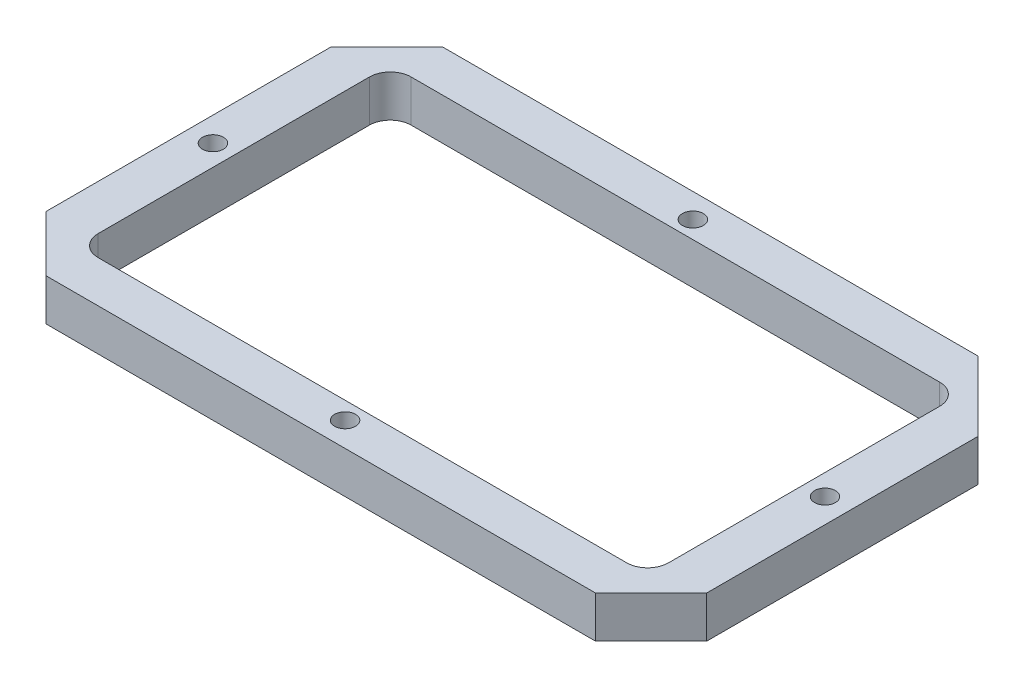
ISO-10303-21;
HEADER;
FILE_DESCRIPTION(('STEP AP214'),'2;1');
FILE_NAME('part.step','',(''),(''),'','','');
FILE_SCHEMA(('AUTOMOTIVE_DESIGN { 1 0 10303 214 1 1 1 1 }'));
ENDSEC;
DATA;
#1=APPLICATION_CONTEXT('core data for automotive mechanical design processes');
#2=APPLICATION_PROTOCOL_DEFINITION('international standard','automotive_design',2000,#1);
#3=PRODUCT_CONTEXT('',#1,'mechanical');
#4=PRODUCT('Part','Part','',(#3));
#5=PRODUCT_RELATED_PRODUCT_CATEGORY('part','',(#4));
#6=PRODUCT_DEFINITION_FORMATION('','',#4);
#7=PRODUCT_DEFINITION_CONTEXT('part definition',#1,'design');
#8=PRODUCT_DEFINITION('design','',#6,#7);
#9=PRODUCT_DEFINITION_SHAPE('','',#8);
#10=(LENGTH_UNIT() NAMED_UNIT(*) SI_UNIT(.MILLI.,.METRE.));
#11=(NAMED_UNIT(*) PLANE_ANGLE_UNIT() SI_UNIT($,.RADIAN.));
#12=(NAMED_UNIT(*) SI_UNIT($,.STERADIAN.) SOLID_ANGLE_UNIT());
#13=UNCERTAINTY_MEASURE_WITH_UNIT(LENGTH_MEASURE(1.E-05),#10,'distance_accuracy_value','');
#14=(GEOMETRIC_REPRESENTATION_CONTEXT(3) GLOBAL_UNCERTAINTY_ASSIGNED_CONTEXT((#13)) GLOBAL_UNIT_ASSIGNED_CONTEXT((#10,
#11,#12)) REPRESENTATION_CONTEXT('',''));
#15=CARTESIAN_POINT('',(0.,0.,0.));
#16=DIRECTION('',(0.,0.,1.));
#17=DIRECTION('',(1.,0.,0.));
#18=AXIS2_PLACEMENT_3D('',#15,#16,#17);
#19=CARTESIAN_POINT('',(0.,6.,0.));
#20=DIRECTION('',(0.,-1.,0.));
#21=DIRECTION('',(0.,0.,-1.));
#22=AXIS2_PLACEMENT_3D('',#19,#20,#21);
#23=PLANE('',#22);
#24=CARTESIAN_POINT('',(-44.,6.,0.));
#25=DIRECTION('',(0.,1.,0.));
#26=DIRECTION('',(0.,0.,1.));
#27=AXIS2_PLACEMENT_3D('',#24,#25,#26);
#28=CIRCLE('',#27,1.5);
#29=CARTESIAN_POINT('',(-44.,6.,1.5));
#30=VERTEX_POINT('',#29);
#31=EDGE_CURVE('E558',#30,#30,#28,.T.);
#32=ORIENTED_EDGE('',*,*,#31,.F.);
#33=EDGE_LOOP('',(#32));
#34=FACE_BOUND('',#33,.T.);
#35=CARTESIAN_POINT('',(0.,6.,-25.));
#36=DIRECTION('',(0.,1.,0.));
#37=DIRECTION('',(0.,0.,1.));
#38=AXIS2_PLACEMENT_3D('',#35,#36,#37);
#39=CIRCLE('',#38,1.5);
#40=CARTESIAN_POINT('',(0.,6.,-23.5));
#41=VERTEX_POINT('',#40);
#42=EDGE_CURVE('E188',#41,#41,#39,.T.);
#43=ORIENTED_EDGE('',*,*,#42,.F.);
#44=EDGE_LOOP('',(#43));
#45=FACE_BOUND('',#44,.T.);
#46=DIRECTION('',(-1.,0.,0.));
#47=VECTOR('',#46,1.);
#48=CARTESIAN_POINT('',(-39.5,6.,-28.5));
#49=LINE('',#48,#47);
#50=CARTESIAN_POINT('',(37.5,6.,-28.5));
#51=VERTEX_POINT('',#50);
#52=CARTESIAN_POINT('',(-39.5,6.,-28.5));
#53=VERTEX_POINT('',#52);
#54=EDGE_CURVE('E218',#51,#53,#49,.T.);
#55=ORIENTED_EDGE('',*,*,#54,.T.);
#56=DIRECTION('',(-0.707106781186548,0.,0.707106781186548));
#57=VECTOR('',#56,1.);
#58=CARTESIAN_POINT('',(-47.5,6.,-20.5));
#59=LINE('',#58,#57);
#60=CARTESIAN_POINT('',(-47.5,6.,-20.5));
#61=VERTEX_POINT('',#60);
#62=EDGE_CURVE('E221',#53,#61,#59,.T.);
#63=ORIENTED_EDGE('',*,*,#62,.T.);
#64=DIRECTION('',(0.,0.,1.));
#65=VECTOR('',#64,1.);
#66=CARTESIAN_POINT('',(-47.5,6.,-20.5));
#67=LINE('',#66,#65);
#68=CARTESIAN_POINT('',(-47.5,6.,20.5));
#69=VERTEX_POINT('',#68);
#70=EDGE_CURVE('E224',#61,#69,#67,.T.);
#71=ORIENTED_EDGE('',*,*,#70,.T.);
#72=DIRECTION('',(0.707106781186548,0.,0.707106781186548));
#73=VECTOR('',#72,1.);
#74=CARTESIAN_POINT('',(-47.5,6.,20.5));
#75=LINE('',#74,#73);
#76=CARTESIAN_POINT('',(-39.5,6.,28.5));
#77=VERTEX_POINT('',#76);
#78=EDGE_CURVE('E226',#69,#77,#75,.T.);
#79=ORIENTED_EDGE('',*,*,#78,.T.);
#80=DIRECTION('',(1.,0.,0.));
#81=VECTOR('',#80,1.);
#82=CARTESIAN_POINT('',(-39.5,6.,28.5));
#83=LINE('',#82,#81);
#84=CARTESIAN_POINT('',(39.5,6.,28.5));
#85=VERTEX_POINT('',#84);
#86=EDGE_CURVE('E228',#77,#85,#83,.T.);
#87=ORIENTED_EDGE('',*,*,#86,.T.);
#88=DIRECTION('',(0.707106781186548,0.,-0.707106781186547));
#89=VECTOR('',#88,1.);
#90=CARTESIAN_POINT('',(39.5,6.,28.5));
#91=LINE('',#90,#89);
#92=CARTESIAN_POINT('',(47.5,6.,20.5));
#93=VERTEX_POINT('',#92);
#94=EDGE_CURVE('E230',#85,#93,#91,.T.);
#95=ORIENTED_EDGE('',*,*,#94,.T.);
#96=DIRECTION('',(0.,0.,-1.));
#97=VECTOR('',#96,1.);
#98=CARTESIAN_POINT('',(47.5,6.,-18.5));
#99=LINE('',#98,#97);
#100=CARTESIAN_POINT('',(47.5,6.,-18.5));
#101=VERTEX_POINT('',#100);
#102=EDGE_CURVE('E232',#93,#101,#99,.T.);
#103=ORIENTED_EDGE('',*,*,#102,.T.);
#104=DIRECTION('',(-0.707106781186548,0.,-0.707106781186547));
#105=VECTOR('',#104,1.);
#106=CARTESIAN_POINT('',(37.5,6.,-28.5));
#107=LINE('',#106,#105);
#108=EDGE_CURVE('E234',#101,#51,#107,.T.);
#109=ORIENTED_EDGE('',*,*,#108,.T.);
#110=EDGE_LOOP('',(#55,#63,#71,#79,#87,#95,#103,#109));
#111=FACE_BOUND('',#110,.T.);
#112=CARTESIAN_POINT('',(-38.,6.,-19.5));
#113=DIRECTION('',(0.,1.,0.));
#114=DIRECTION('',(0.,0.,1.));
#115=AXIS2_PLACEMENT_3D('',#112,#113,#114);
#116=CIRCLE('',#115,3.);
#117=CARTESIAN_POINT('',(-38.,6.,-22.5));
#118=VERTEX_POINT('',#117);
#119=CARTESIAN_POINT('',(-41.,6.,-19.5));
#120=VERTEX_POINT('',#119);
#121=EDGE_CURVE('E150',#118,#120,#116,.T.);
#122=ORIENTED_EDGE('',*,*,#121,.F.);
#123=DIRECTION('',(-1.,0.,0.));
#124=VECTOR('',#123,1.);
#125=CARTESIAN_POINT('',(-38.,6.,-22.5));
#126=LINE('',#125,#124);
#127=CARTESIAN_POINT('',(38.,6.,-22.5));
#128=VERTEX_POINT('',#127);
#129=EDGE_CURVE('E185',#128,#118,#126,.T.);
#130=ORIENTED_EDGE('',*,*,#129,.F.);
#131=CARTESIAN_POINT('',(38.,6.,-19.5));
#132=DIRECTION('',(0.,1.,0.));
#133=DIRECTION('',(0.,0.,-1.));
#134=AXIS2_PLACEMENT_3D('',#131,#132,#133);
#135=CIRCLE('',#134,3.);
#136=CARTESIAN_POINT('',(41.,6.,-19.5));
#137=VERTEX_POINT('',#136);
#138=EDGE_CURVE('E183',#137,#128,#135,.T.);
#139=ORIENTED_EDGE('',*,*,#138,.F.);
#140=DIRECTION('',(0.,0.,-1.));
#141=VECTOR('',#140,1.);
#142=CARTESIAN_POINT('',(41.,6.,-19.5));
#143=LINE('',#142,#141);
#144=CARTESIAN_POINT('',(41.,6.,19.5));
#145=VERTEX_POINT('',#144);
#146=EDGE_CURVE('E181',#145,#137,#143,.T.);
#147=ORIENTED_EDGE('',*,*,#146,.F.);
#148=CARTESIAN_POINT('',(38.,6.,19.5));
#149=DIRECTION('',(0.,1.,0.));
#150=DIRECTION('',(0.,0.,1.));
#151=AXIS2_PLACEMENT_3D('',#148,#149,#150);
#152=CIRCLE('',#151,3.);
#153=CARTESIAN_POINT('',(38.,6.,22.5));
#154=VERTEX_POINT('',#153);
#155=EDGE_CURVE('E179',#154,#145,#152,.T.);
#156=ORIENTED_EDGE('',*,*,#155,.F.);
#157=DIRECTION('',(1.,0.,0.));
#158=VECTOR('',#157,1.);
#159=CARTESIAN_POINT('',(-38.,6.,22.5));
#160=LINE('',#159,#158);
#161=CARTESIAN_POINT('',(-38.,6.,22.5));
#162=VERTEX_POINT('',#161);
#163=EDGE_CURVE('E174',#162,#154,#160,.T.);
#164=ORIENTED_EDGE('',*,*,#163,.F.);
#165=CARTESIAN_POINT('',(-38.,6.,19.5));
#166=DIRECTION('',(0.,1.,0.));
#167=DIRECTION('',(0.,0.,1.));
#168=AXIS2_PLACEMENT_3D('',#165,#166,#167);
#169=CIRCLE('',#168,3.);
#170=CARTESIAN_POINT('',(-41.,6.,19.5));
#171=VERTEX_POINT('',#170);
#172=EDGE_CURVE('E172',#171,#162,#169,.T.);
#173=ORIENTED_EDGE('',*,*,#172,.F.);
#174=DIRECTION('',(0.,0.,1.));
#175=VECTOR('',#174,1.);
#176=CARTESIAN_POINT('',(-41.,6.,-19.5));
#177=LINE('',#176,#175);
#178=EDGE_CURVE('E158',#120,#171,#177,.T.);
#179=ORIENTED_EDGE('',*,*,#178,.F.);
#180=EDGE_LOOP('',(#122,#130,#139,#147,#156,#164,#173,#179));
#181=FACE_BOUND('',#180,.T.);
#182=CARTESIAN_POINT('',(0.,6.,25.));
#183=DIRECTION('',(0.,1.,0.));
#184=DIRECTION('',(0.,0.,-1.));
#185=AXIS2_PLACEMENT_3D('',#182,#183,#184);
#186=CIRCLE('',#185,1.5);
#187=CARTESIAN_POINT('',(0.,6.,23.5));
#188=VERTEX_POINT('',#187);
#189=EDGE_CURVE('E557',#188,#188,#186,.T.);
#190=ORIENTED_EDGE('',*,*,#189,.F.);
#191=EDGE_LOOP('',(#190));
#192=FACE_BOUND('',#191,.T.);
#193=CARTESIAN_POINT('',(44.,6.,0.));
#194=DIRECTION('',(0.,1.,0.));
#195=DIRECTION('',(0.,0.,-1.));
#196=AXIS2_PLACEMENT_3D('',#193,#194,#195);
#197=CIRCLE('',#196,1.5);
#198=CARTESIAN_POINT('',(44.,6.,-1.50000000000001));
#199=VERTEX_POINT('',#198);
#200=EDGE_CURVE('E344',#199,#199,#197,.T.);
#201=ORIENTED_EDGE('',*,*,#200,.F.);
#202=EDGE_LOOP('',(#201));
#203=FACE_BOUND('',#202,.T.);
#204=ADVANCED_FACE('F37',(#34,#45,#111,#181,#192,#203),#23,.F.);
#205=CARTESIAN_POINT('',(0.,0.,0.));
#206=DIRECTION('',(0.,-1.,0.));
#207=DIRECTION('',(0.,0.,-1.));
#208=AXIS2_PLACEMENT_3D('',#205,#206,#207);
#209=PLANE('',#208);
#210=CARTESIAN_POINT('',(-44.,0.,0.));
#211=DIRECTION('',(0.,1.,0.));
#212=DIRECTION('',(0.,0.,1.));
#213=AXIS2_PLACEMENT_3D('',#210,#211,#212);
#214=CIRCLE('',#213,1.5);
#215=CARTESIAN_POINT('',(-44.,0.,1.5));
#216=VERTEX_POINT('',#215);
#217=EDGE_CURVE('E564',#216,#216,#214,.T.);
#218=ORIENTED_EDGE('',*,*,#217,.T.);
#219=EDGE_LOOP('',(#218));
#220=FACE_BOUND('',#219,.T.);
#221=CARTESIAN_POINT('',(0.,0.,-25.));
#222=DIRECTION('',(0.,1.,0.));
#223=DIRECTION('',(0.,0.,1.));
#224=AXIS2_PLACEMENT_3D('',#221,#222,#223);
#225=CIRCLE('',#224,1.5);
#226=CARTESIAN_POINT('',(0.,0.,-23.5));
#227=VERTEX_POINT('',#226);
#228=EDGE_CURVE('E561',#227,#227,#225,.T.);
#229=ORIENTED_EDGE('',*,*,#228,.T.);
#230=EDGE_LOOP('',(#229));
#231=FACE_BOUND('',#230,.T.);
#232=DIRECTION('',(-1.,0.,0.));
#233=VECTOR('',#232,1.);
#234=CARTESIAN_POINT('',(-39.5,0.,-28.5));
#235=LINE('',#234,#233);
#236=CARTESIAN_POINT('',(37.5,0.,-28.5));
#237=VERTEX_POINT('',#236);
#238=CARTESIAN_POINT('',(-39.5,0.,-28.5));
#239=VERTEX_POINT('',#238);
#240=EDGE_CURVE('E166',#237,#239,#235,.T.);
#241=ORIENTED_EDGE('',*,*,#240,.F.);
#242=DIRECTION('',(-0.707106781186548,0.,-0.707106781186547));
#243=VECTOR('',#242,1.);
#244=CARTESIAN_POINT('',(37.5,0.,-28.5));
#245=LINE('',#244,#243);
#246=CARTESIAN_POINT('',(47.5,0.,-18.5));
#247=VERTEX_POINT('',#246);
#248=EDGE_CURVE('E222',#247,#237,#245,.T.);
#249=ORIENTED_EDGE('',*,*,#248,.F.);
#250=DIRECTION('',(0.,0.,-1.));
#251=VECTOR('',#250,1.);
#252=CARTESIAN_POINT('',(47.5,0.,-18.5));
#253=LINE('',#252,#251);
#254=CARTESIAN_POINT('',(47.5,0.,20.5));
#255=VERTEX_POINT('',#254);
#256=EDGE_CURVE('E249',#255,#247,#253,.T.);
#257=ORIENTED_EDGE('',*,*,#256,.F.);
#258=DIRECTION('',(0.707106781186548,0.,-0.707106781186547));
#259=VECTOR('',#258,1.);
#260=CARTESIAN_POINT('',(39.5,0.,28.5));
#261=LINE('',#260,#259);
#262=CARTESIAN_POINT('',(39.5,0.,28.5));
#263=VERTEX_POINT('',#262);
#264=EDGE_CURVE('E247',#263,#255,#261,.T.);
#265=ORIENTED_EDGE('',*,*,#264,.F.);
#266=DIRECTION('',(1.,0.,0.));
#267=VECTOR('',#266,1.);
#268=CARTESIAN_POINT('',(-39.5,0.,28.5));
#269=LINE('',#268,#267);
#270=CARTESIAN_POINT('',(-39.5,0.,28.5));
#271=VERTEX_POINT('',#270);
#272=EDGE_CURVE('E245',#271,#263,#269,.T.);
#273=ORIENTED_EDGE('',*,*,#272,.F.);
#274=DIRECTION('',(0.707106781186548,0.,0.707106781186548));
#275=VECTOR('',#274,1.);
#276=CARTESIAN_POINT('',(-47.5,0.,20.5));
#277=LINE('',#276,#275);
#278=CARTESIAN_POINT('',(-47.5,0.,20.5));
#279=VERTEX_POINT('',#278);
#280=EDGE_CURVE('E243',#279,#271,#277,.T.);
#281=ORIENTED_EDGE('',*,*,#280,.F.);
#282=DIRECTION('',(0.,0.,1.));
#283=VECTOR('',#282,1.);
#284=CARTESIAN_POINT('',(-47.5,0.,-20.5));
#285=LINE('',#284,#283);
#286=CARTESIAN_POINT('',(-47.5,0.,-20.5));
#287=VERTEX_POINT('',#286);
#288=EDGE_CURVE('E241',#287,#279,#285,.T.);
#289=ORIENTED_EDGE('',*,*,#288,.F.);
#290=DIRECTION('',(-0.707106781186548,0.,0.707106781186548));
#291=VECTOR('',#290,1.);
#292=CARTESIAN_POINT('',(-47.5,0.,-20.5));
#293=LINE('',#292,#291);
#294=EDGE_CURVE('E239',#239,#287,#293,.T.);
#295=ORIENTED_EDGE('',*,*,#294,.F.);
#296=EDGE_LOOP('',(#241,#249,#257,#265,#273,#281,#289,#295));
#297=FACE_BOUND('',#296,.T.);
#298=DIRECTION('',(-1.,0.,0.));
#299=VECTOR('',#298,1.);
#300=CARTESIAN_POINT('',(-38.,0.,-22.5));
#301=LINE('',#300,#299);
#302=CARTESIAN_POINT('',(38.,0.,-22.5));
#303=VERTEX_POINT('',#302);
#304=CARTESIAN_POINT('',(-38.,0.,-22.5));
#305=VERTEX_POINT('',#304);
#306=EDGE_CURVE('E159',#303,#305,#301,.T.);
#307=ORIENTED_EDGE('',*,*,#306,.T.);
#308=CARTESIAN_POINT('',(-38.,0.,-19.5));
#309=DIRECTION('',(0.,1.,0.));
#310=DIRECTION('',(0.,0.,1.));
#311=AXIS2_PLACEMENT_3D('',#308,#309,#310);
#312=CIRCLE('',#311,3.);
#313=CARTESIAN_POINT('',(-41.,0.,-19.5));
#314=VERTEX_POINT('',#313);
#315=EDGE_CURVE('E60',#305,#314,#312,.T.);
#316=ORIENTED_EDGE('',*,*,#315,.T.);
#317=DIRECTION('',(0.,0.,1.));
#318=VECTOR('',#317,1.);
#319=CARTESIAN_POINT('',(-41.,0.,-19.5));
#320=LINE('',#319,#318);
#321=CARTESIAN_POINT('',(-41.,0.,19.5));
#322=VERTEX_POINT('',#321);
#323=EDGE_CURVE('E165',#314,#322,#320,.T.);
#324=ORIENTED_EDGE('',*,*,#323,.T.);
#325=CARTESIAN_POINT('',(-38.,0.,19.5));
#326=DIRECTION('',(0.,1.,0.));
#327=DIRECTION('',(0.,0.,1.));
#328=AXIS2_PLACEMENT_3D('',#325,#326,#327);
#329=CIRCLE('',#328,3.);
#330=CARTESIAN_POINT('',(-38.,0.,22.5));
#331=VERTEX_POINT('',#330);
#332=EDGE_CURVE('E190',#322,#331,#329,.T.);
#333=ORIENTED_EDGE('',*,*,#332,.T.);
#334=DIRECTION('',(1.,0.,0.));
#335=VECTOR('',#334,1.);
#336=CARTESIAN_POINT('',(-38.,0.,22.5));
#337=LINE('',#336,#335);
#338=CARTESIAN_POINT('',(38.,0.,22.5));
#339=VERTEX_POINT('',#338);
#340=EDGE_CURVE('E193',#331,#339,#337,.T.);
#341=ORIENTED_EDGE('',*,*,#340,.T.);
#342=CARTESIAN_POINT('',(38.,0.,19.5));
#343=DIRECTION('',(0.,1.,0.));
#344=DIRECTION('',(0.,0.,1.));
#345=AXIS2_PLACEMENT_3D('',#342,#343,#344);
#346=CIRCLE('',#345,3.);
#347=CARTESIAN_POINT('',(41.,0.,19.5));
#348=VERTEX_POINT('',#347);
#349=EDGE_CURVE('E196',#339,#348,#346,.T.);
#350=ORIENTED_EDGE('',*,*,#349,.T.);
#351=DIRECTION('',(0.,0.,-1.));
#352=VECTOR('',#351,1.);
#353=CARTESIAN_POINT('',(41.,0.,-19.5));
#354=LINE('',#353,#352);
#355=CARTESIAN_POINT('',(41.,0.,-19.5));
#356=VERTEX_POINT('',#355);
#357=EDGE_CURVE('E199',#348,#356,#354,.T.);
#358=ORIENTED_EDGE('',*,*,#357,.T.);
#359=CARTESIAN_POINT('',(38.,0.,-19.5));
#360=DIRECTION('',(0.,1.,0.));
#361=DIRECTION('',(0.,0.,-1.));
#362=AXIS2_PLACEMENT_3D('',#359,#360,#361);
#363=CIRCLE('',#362,3.);
#364=EDGE_CURVE('E202',#356,#303,#363,.T.);
#365=ORIENTED_EDGE('',*,*,#364,.T.);
#366=EDGE_LOOP('',(#307,#316,#324,#333,#341,#350,#358,#365));
#367=FACE_BOUND('',#366,.T.);
#368=CARTESIAN_POINT('',(0.,0.,25.));
#369=DIRECTION('',(0.,1.,0.));
#370=DIRECTION('',(0.,0.,-1.));
#371=AXIS2_PLACEMENT_3D('',#368,#369,#370);
#372=CIRCLE('',#371,1.5);
#373=CARTESIAN_POINT('',(0.,0.,23.5));
#374=VERTEX_POINT('',#373);
#375=EDGE_CURVE('E553',#374,#374,#372,.T.);
#376=ORIENTED_EDGE('',*,*,#375,.T.);
#377=EDGE_LOOP('',(#376));
#378=FACE_BOUND('',#377,.T.);
#379=CARTESIAN_POINT('',(44.,0.,0.));
#380=DIRECTION('',(0.,1.,0.));
#381=DIRECTION('',(0.,0.,-1.));
#382=AXIS2_PLACEMENT_3D('',#379,#380,#381);
#383=CIRCLE('',#382,1.5);
#384=CARTESIAN_POINT('',(44.,0.,-1.50000000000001));
#385=VERTEX_POINT('',#384);
#386=EDGE_CURVE('E340',#385,#385,#383,.T.);
#387=ORIENTED_EDGE('',*,*,#386,.T.);
#388=EDGE_LOOP('',(#387));
#389=FACE_BOUND('',#388,.T.);
#390=ADVANCED_FACE('F279',(#220,#231,#297,#367,#378,#389),#209,.T.);
#391=CARTESIAN_POINT('',(-39.5,6.,-28.5));
#392=DIRECTION('',(0.,0.,1.));
#393=DIRECTION('',(1.,0.,0.));
#394=AXIS2_PLACEMENT_3D('',#391,#392,#393);
#395=PLANE('',#394);
#396=ORIENTED_EDGE('',*,*,#240,.T.);
#397=DIRECTION('',(0.,-1.,0.));
#398=VECTOR('',#397,1.);
#399=CARTESIAN_POINT('',(-39.5,6.,-28.5));
#400=LINE('',#399,#398);
#401=EDGE_CURVE('E11',#53,#239,#400,.T.);
#402=ORIENTED_EDGE('',*,*,#401,.F.);
#403=ORIENTED_EDGE('',*,*,#54,.F.);
#404=DIRECTION('',(0.,-1.,0.));
#405=VECTOR('',#404,1.);
#406=CARTESIAN_POINT('',(37.5,6.,-28.5));
#407=LINE('',#406,#405);
#408=EDGE_CURVE('E236',#51,#237,#407,.T.);
#409=ORIENTED_EDGE('',*,*,#408,.T.);
#410=EDGE_LOOP('',(#396,#402,#403,#409));
#411=FACE_BOUND('',#410,.T.);
#412=ADVANCED_FACE('F39',(#411),#395,.F.);
#413=CARTESIAN_POINT('',(-47.5,6.,-20.5));
#414=DIRECTION('',(0.707106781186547,0.,0.707106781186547));
#415=DIRECTION('',(0.707106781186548,0.,-0.707106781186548));
#416=AXIS2_PLACEMENT_3D('',#413,#414,#415);
#417=PLANE('',#416);
#418=ORIENTED_EDGE('',*,*,#294,.T.);
#419=DIRECTION('',(0.,-1.,0.));
#420=VECTOR('',#419,1.);
#421=CARTESIAN_POINT('',(-47.5,6.,-20.5));
#422=LINE('',#421,#420);
#423=EDGE_CURVE('E45',#61,#287,#422,.T.);
#424=ORIENTED_EDGE('',*,*,#423,.F.);
#425=ORIENTED_EDGE('',*,*,#62,.F.);
#426=ORIENTED_EDGE('',*,*,#401,.T.);
#427=EDGE_LOOP('',(#418,#424,#425,#426));
#428=FACE_BOUND('',#427,.T.);
#429=ADVANCED_FACE('F296',(#428),#417,.F.);
#430=CARTESIAN_POINT('',(-47.5,6.,-20.5));
#431=DIRECTION('',(1.,0.,0.));
#432=DIRECTION('',(0.,0.,-1.));
#433=AXIS2_PLACEMENT_3D('',#430,#431,#432);
#434=PLANE('',#433);
#435=ORIENTED_EDGE('',*,*,#288,.T.);
#436=DIRECTION('',(0.,-1.,0.));
#437=VECTOR('',#436,1.);
#438=CARTESIAN_POINT('',(-47.5,6.,20.5));
#439=LINE('',#438,#437);
#440=EDGE_CURVE('E266',#69,#279,#439,.T.);
#441=ORIENTED_EDGE('',*,*,#440,.F.);
#442=ORIENTED_EDGE('',*,*,#70,.F.);
#443=ORIENTED_EDGE('',*,*,#423,.T.);
#444=EDGE_LOOP('',(#435,#441,#442,#443));
#445=FACE_BOUND('',#444,.T.);
#446=ADVANCED_FACE('F273',(#445),#434,.F.);
#447=CARTESIAN_POINT('',(-47.5,6.,20.5));
#448=DIRECTION('',(0.707106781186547,0.,-0.707106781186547));
#449=DIRECTION('',(-0.707106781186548,0.,-0.707106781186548));
#450=AXIS2_PLACEMENT_3D('',#447,#448,#449);
#451=PLANE('',#450);
#452=ORIENTED_EDGE('',*,*,#280,.T.);
#453=DIRECTION('',(0.,-1.,0.));
#454=VECTOR('',#453,1.);
#455=CARTESIAN_POINT('',(-39.5,6.,28.5));
#456=LINE('',#455,#454);
#457=EDGE_CURVE('E263',#77,#271,#456,.T.);
#458=ORIENTED_EDGE('',*,*,#457,.F.);
#459=ORIENTED_EDGE('',*,*,#78,.F.);
#460=ORIENTED_EDGE('',*,*,#440,.T.);
#461=EDGE_LOOP('',(#452,#458,#459,#460));
#462=FACE_BOUND('',#461,.T.);
#463=ADVANCED_FACE('F285',(#462),#451,.F.);
#464=CARTESIAN_POINT('',(-39.5,6.,28.5));
#465=DIRECTION('',(0.,0.,-1.));
#466=DIRECTION('',(-1.,0.,0.));
#467=AXIS2_PLACEMENT_3D('',#464,#465,#466);
#468=PLANE('',#467);
#469=ORIENTED_EDGE('',*,*,#272,.T.);
#470=DIRECTION('',(0.,-1.,0.));
#471=VECTOR('',#470,1.);
#472=CARTESIAN_POINT('',(39.5,6.,28.5));
#473=LINE('',#472,#471);
#474=EDGE_CURVE('E260',#85,#263,#473,.T.);
#475=ORIENTED_EDGE('',*,*,#474,.F.);
#476=ORIENTED_EDGE('',*,*,#86,.F.);
#477=ORIENTED_EDGE('',*,*,#457,.T.);
#478=EDGE_LOOP('',(#469,#475,#476,#477));
#479=FACE_BOUND('',#478,.T.);
#480=ADVANCED_FACE('F289',(#479),#468,.F.);
#481=CARTESIAN_POINT('',(39.5,6.,28.5));
#482=DIRECTION('',(-0.707106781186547,0.,-0.707106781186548));
#483=DIRECTION('',(-0.707106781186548,0.,0.707106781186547));
#484=AXIS2_PLACEMENT_3D('',#481,#482,#483);
#485=PLANE('',#484);
#486=ORIENTED_EDGE('',*,*,#264,.T.);
#487=DIRECTION('',(0.,-1.,0.));
#488=VECTOR('',#487,1.);
#489=CARTESIAN_POINT('',(47.5,6.,20.5));
#490=LINE('',#489,#488);
#491=EDGE_CURVE('E257',#93,#255,#490,.T.);
#492=ORIENTED_EDGE('',*,*,#491,.F.);
#493=ORIENTED_EDGE('',*,*,#94,.F.);
#494=ORIENTED_EDGE('',*,*,#474,.T.);
#495=EDGE_LOOP('',(#486,#492,#493,#494));
#496=FACE_BOUND('',#495,.T.);
#497=ADVANCED_FACE('F309',(#496),#485,.F.);
#498=CARTESIAN_POINT('',(47.5,6.,-18.5));
#499=DIRECTION('',(-1.,0.,0.));
#500=DIRECTION('',(0.,0.,1.));
#501=AXIS2_PLACEMENT_3D('',#498,#499,#500);
#502=PLANE('',#501);
#503=ORIENTED_EDGE('',*,*,#256,.T.);
#504=DIRECTION('',(0.,-1.,0.));
#505=VECTOR('',#504,1.);
#506=CARTESIAN_POINT('',(47.5,6.,-18.5));
#507=LINE('',#506,#505);
#508=EDGE_CURVE('E254',#101,#247,#507,.T.);
#509=ORIENTED_EDGE('',*,*,#508,.F.);
#510=ORIENTED_EDGE('',*,*,#102,.F.);
#511=ORIENTED_EDGE('',*,*,#491,.T.);
#512=EDGE_LOOP('',(#503,#509,#510,#511));
#513=FACE_BOUND('',#512,.T.);
#514=ADVANCED_FACE('F307',(#513),#502,.F.);
#515=CARTESIAN_POINT('',(37.5,6.,-28.5));
#516=DIRECTION('',(-0.707106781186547,0.,0.707106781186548));
#517=DIRECTION('',(0.707106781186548,0.,0.707106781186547));
#518=AXIS2_PLACEMENT_3D('',#515,#516,#517);
#519=PLANE('',#518);
#520=CARTESIAN_POINT('',(42.5,3.,-23.5));
#521=DIRECTION('',(0.707106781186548,0.,-0.707106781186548));
#522=DIRECTION('',(-0.707106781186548,0.,-0.707106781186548));
#523=AXIS2_PLACEMENT_3D('',#520,#521,#522);
#524=CIRCLE('',#523,1.);
#525=CARTESIAN_POINT('',(41.7928932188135,3.,-24.2071067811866));
#526=VERTEX_POINT('',#525);
#527=EDGE_CURVE('E338',#526,#526,#524,.T.);
#528=ORIENTED_EDGE('',*,*,#527,.F.);
#529=EDGE_LOOP('',(#528));
#530=FACE_BOUND('',#529,.T.);
#531=ORIENTED_EDGE('',*,*,#248,.T.);
#532=ORIENTED_EDGE('',*,*,#408,.F.);
#533=ORIENTED_EDGE('',*,*,#108,.F.);
#534=ORIENTED_EDGE('',*,*,#508,.T.);
#535=EDGE_LOOP('',(#531,#532,#533,#534));
#536=FACE_BOUND('',#535,.T.);
#537=ADVANCED_FACE('F302',(#530,#536),#519,.F.);
#538=CARTESIAN_POINT('',(-38.,6.,-19.5));
#539=DIRECTION('',(0.,-1.,0.));
#540=DIRECTION('',(0.,0.,-1.));
#541=AXIS2_PLACEMENT_3D('',#538,#539,#540);
#542=CYLINDRICAL_SURFACE('',#541,3.);
#543=ORIENTED_EDGE('',*,*,#315,.F.);
#544=DIRECTION('',(0.,-1.,0.));
#545=VECTOR('',#544,1.);
#546=CARTESIAN_POINT('',(-38.,6.,-22.5));
#547=LINE('',#546,#545);
#548=EDGE_CURVE('E154',#118,#305,#547,.T.);
#549=ORIENTED_EDGE('',*,*,#548,.F.);
#550=ORIENTED_EDGE('',*,*,#121,.T.);
#551=DIRECTION('',(0.,-1.,0.));
#552=VECTOR('',#551,1.);
#553=CARTESIAN_POINT('',(-41.,6.,-19.5));
#554=LINE('',#553,#552);
#555=EDGE_CURVE('E153',#120,#314,#554,.T.);
#556=ORIENTED_EDGE('',*,*,#555,.T.);
#557=EDGE_LOOP('',(#543,#549,#550,#556));
#558=FACE_BOUND('',#557,.T.);
#559=ADVANCED_FACE('F152',(#558),#542,.F.);
#560=CARTESIAN_POINT('',(-41.,6.,-19.5));
#561=DIRECTION('',(1.,0.,0.));
#562=DIRECTION('',(0.,0.,-1.));
#563=AXIS2_PLACEMENT_3D('',#560,#561,#562);
#564=PLANE('',#563);
#565=ORIENTED_EDGE('',*,*,#323,.F.);
#566=ORIENTED_EDGE('',*,*,#555,.F.);
#567=ORIENTED_EDGE('',*,*,#178,.T.);
#568=DIRECTION('',(0.,-1.,0.));
#569=VECTOR('',#568,1.);
#570=CARTESIAN_POINT('',(-41.,6.,19.5));
#571=LINE('',#570,#569);
#572=EDGE_CURVE('E167',#171,#322,#571,.T.);
#573=ORIENTED_EDGE('',*,*,#572,.T.);
#574=EDGE_LOOP('',(#565,#566,#567,#573));
#575=FACE_BOUND('',#574,.T.);
#576=ADVANCED_FACE('F162',(#575),#564,.T.);
#577=CARTESIAN_POINT('',(-38.,6.,19.5));
#578=DIRECTION('',(0.,-1.,0.));
#579=DIRECTION('',(0.,0.,-1.));
#580=AXIS2_PLACEMENT_3D('',#577,#578,#579);
#581=CYLINDRICAL_SURFACE('',#580,3.);
#582=ORIENTED_EDGE('',*,*,#332,.F.);
#583=ORIENTED_EDGE('',*,*,#572,.F.);
#584=ORIENTED_EDGE('',*,*,#172,.T.);
#585=DIRECTION('',(0.,-1.,0.));
#586=VECTOR('',#585,1.);
#587=CARTESIAN_POINT('',(-38.,6.,22.5));
#588=LINE('',#587,#586);
#589=EDGE_CURVE('E215',#162,#331,#588,.T.);
#590=ORIENTED_EDGE('',*,*,#589,.T.);
#591=EDGE_LOOP('',(#582,#583,#584,#590));
#592=FACE_BOUND('',#591,.T.);
#593=ADVANCED_FACE('F393',(#592),#581,.F.);
#594=CARTESIAN_POINT('',(-38.,6.,22.5));
#595=DIRECTION('',(0.,0.,-1.));
#596=DIRECTION('',(-1.,0.,0.));
#597=AXIS2_PLACEMENT_3D('',#594,#595,#596);
#598=PLANE('',#597);
#599=ORIENTED_EDGE('',*,*,#340,.F.);
#600=ORIENTED_EDGE('',*,*,#589,.F.);
#601=ORIENTED_EDGE('',*,*,#163,.T.);
#602=DIRECTION('',(0.,-1.,0.));
#603=VECTOR('',#602,1.);
#604=CARTESIAN_POINT('',(38.,6.,22.5));
#605=LINE('',#604,#603);
#606=EDGE_CURVE('E213',#154,#339,#605,.T.);
#607=ORIENTED_EDGE('',*,*,#606,.T.);
#608=EDGE_LOOP('',(#599,#600,#601,#607));
#609=FACE_BOUND('',#608,.T.);
#610=ADVANCED_FACE('F389',(#609),#598,.T.);
#611=CARTESIAN_POINT('',(38.,6.,19.5));
#612=DIRECTION('',(0.,-1.,0.));
#613=DIRECTION('',(0.,0.,-1.));
#614=AXIS2_PLACEMENT_3D('',#611,#612,#613);
#615=CYLINDRICAL_SURFACE('',#614,3.);
#616=ORIENTED_EDGE('',*,*,#349,.F.);
#617=ORIENTED_EDGE('',*,*,#606,.F.);
#618=ORIENTED_EDGE('',*,*,#155,.T.);
#619=DIRECTION('',(0.,-1.,0.));
#620=VECTOR('',#619,1.);
#621=CARTESIAN_POINT('',(41.,6.,19.5));
#622=LINE('',#621,#620);
#623=EDGE_CURVE('E211',#145,#348,#622,.T.);
#624=ORIENTED_EDGE('',*,*,#623,.T.);
#625=EDGE_LOOP('',(#616,#617,#618,#624));
#626=FACE_BOUND('',#625,.T.);
#627=ADVANCED_FACE('F385',(#626),#615,.F.);
#628=CARTESIAN_POINT('',(41.,6.,-19.5));
#629=DIRECTION('',(-1.,0.,0.));
#630=DIRECTION('',(0.,0.,1.));
#631=AXIS2_PLACEMENT_3D('',#628,#629,#630);
#632=PLANE('',#631);
#633=ORIENTED_EDGE('',*,*,#357,.F.);
#634=ORIENTED_EDGE('',*,*,#623,.F.);
#635=ORIENTED_EDGE('',*,*,#146,.T.);
#636=DIRECTION('',(0.,-1.,0.));
#637=VECTOR('',#636,1.);
#638=CARTESIAN_POINT('',(41.,6.,-19.5));
#639=LINE('',#638,#637);
#640=EDGE_CURVE('E209',#137,#356,#639,.T.);
#641=ORIENTED_EDGE('',*,*,#640,.T.);
#642=EDGE_LOOP('',(#633,#634,#635,#641));
#643=FACE_BOUND('',#642,.T.);
#644=ADVANCED_FACE('F381',(#643),#632,.T.);
#645=CARTESIAN_POINT('',(38.,6.,-19.5));
#646=DIRECTION('',(0.,-1.,0.));
#647=DIRECTION('',(0.,0.,-1.));
#648=AXIS2_PLACEMENT_3D('',#645,#646,#647);
#649=CYLINDRICAL_SURFACE('',#648,3.);
#650=CARTESIAN_POINT('',(39.6143790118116,3.,-22.0285925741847));
#651=CARTESIAN_POINT('',(39.6143789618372,3.0556139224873,-22.0285925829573));
#652=CARTESIAN_POINT('',(39.6184029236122,3.11122751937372,-22.0260369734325));
#653=CARTESIAN_POINT('',(39.6342677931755,3.22084500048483,-22.0158013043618));
#654=CARTESIAN_POINT('',(39.6461094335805,3.27484873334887,-22.0081207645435));
#655=CARTESIAN_POINT('',(39.6769462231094,3.37968202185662,-21.9876075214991));
#656=CARTESIAN_POINT('',(39.6959347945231,3.43051444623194,-21.9747795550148));
#657=CARTESIAN_POINT('',(39.740107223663,3.52771479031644,-21.943921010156));
#658=CARTESIAN_POINT('',(39.7652919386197,3.57408209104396,-21.9258897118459));
#659=CARTESIAN_POINT('',(39.8211115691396,3.66181348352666,-21.8842776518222));
#660=CARTESIAN_POINT('',(39.8518243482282,3.70308966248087,-21.8606158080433));
#661=CARTESIAN_POINT('',(39.9170487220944,3.77865445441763,-21.8079595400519));
#662=CARTESIAN_POINT('',(39.9515601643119,3.81294334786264,-21.7789653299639));
#663=CARTESIAN_POINT('',(40.0227762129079,3.87342982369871,-21.7159930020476));
#664=CARTESIAN_POINT('',(40.0594733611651,3.89965322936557,-21.6820313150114));
#665=CARTESIAN_POINT('',(40.1336131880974,3.94333597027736,-21.609591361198));
#666=CARTESIAN_POINT('',(40.1710556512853,3.96079780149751,-21.5711143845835));
#667=CARTESIAN_POINT('',(40.2439047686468,3.98599786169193,-21.491905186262));
#668=CARTESIAN_POINT('',(40.2793371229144,3.99405029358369,-21.4512962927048));
#669=CARTESIAN_POINT('',(40.3482918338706,4.00136477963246,-21.3677415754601));
#670=CARTESIAN_POINT('',(40.3818143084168,4.00062737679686,-21.3247958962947));
#671=CARTESIAN_POINT('',(40.4456901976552,3.99061030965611,-21.238236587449));
#672=CARTESIAN_POINT('',(40.4760714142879,3.98141430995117,-21.1946336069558));
#673=CARTESIAN_POINT('',(40.5334368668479,3.95504891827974,-21.1076121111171));
#674=CARTESIAN_POINT('',(40.5604204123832,3.93787790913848,-21.0641936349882));
#675=CARTESIAN_POINT('',(40.6118364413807,3.89519336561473,-20.9768200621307));
#676=CARTESIAN_POINT('',(40.6360941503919,3.86933196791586,-20.9329323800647));
#677=CARTESIAN_POINT('',(40.6804742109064,3.81026724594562,-20.8480927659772));
#678=CARTESIAN_POINT('',(40.7005947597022,3.77706073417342,-20.8071421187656));
#679=CARTESIAN_POINT('',(40.737888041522,3.70183849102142,-20.7272042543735));
#680=CARTESIAN_POINT('',(40.7548092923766,3.65941179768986,-20.6884850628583));
#681=CARTESIAN_POINT('',(40.7843303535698,3.56805998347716,-20.6175791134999));
#682=CARTESIAN_POINT('',(40.7969297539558,3.51913424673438,-20.5853929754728));
#683=CARTESIAN_POINT('',(40.8179500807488,3.41640909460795,-20.5295832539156));
#684=CARTESIAN_POINT('',(40.8264105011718,3.36266177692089,-20.5058793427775));
#685=CARTESIAN_POINT('',(40.8395234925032,3.25142086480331,-20.4682513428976));
#686=CARTESIAN_POINT('',(40.8441798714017,3.19393107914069,-20.4543174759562));
#687=CARTESIAN_POINT('',(40.8495444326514,3.08277105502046,-20.4381688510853));
#688=CARTESIAN_POINT('',(40.8505871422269,3.02926023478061,-20.4349621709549));
#689=CARTESIAN_POINT('',(40.8496858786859,2.92250626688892,-20.4377063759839));
#690=CARTESIAN_POINT('',(40.8477426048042,2.86926305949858,-20.4436551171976));
#691=CARTESIAN_POINT('',(40.8410250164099,2.76766302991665,-20.4636791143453));
#692=CARTESIAN_POINT('',(40.8364158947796,2.7191997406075,-20.477279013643));
#693=CARTESIAN_POINT('',(40.8244187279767,2.6251599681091,-20.511426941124));
#694=CARTESIAN_POINT('',(40.8170300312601,2.57958416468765,-20.5319765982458));
#695=CARTESIAN_POINT('',(40.7988241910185,2.48964348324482,-20.5804114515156));
#696=CARTESIAN_POINT('',(40.7878298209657,2.4455104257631,-20.6086591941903));
#697=CARTESIAN_POINT('',(40.7624057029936,2.36232134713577,-20.6705699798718));
#698=CARTESIAN_POINT('',(40.747974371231,2.3232676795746,-20.7042355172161));
#699=CARTESIAN_POINT('',(40.71394333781,2.24745456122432,-20.7792033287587));
#700=CARTESIAN_POINT('',(40.6939807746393,2.21127403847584,-20.8209283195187));
#701=CARTESIAN_POINT('',(40.6495750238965,2.14668448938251,-20.9078830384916));
#702=CARTESIAN_POINT('',(40.6251307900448,2.11827728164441,-20.9531135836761));
#703=CARTESIAN_POINT('',(40.5711439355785,2.06948319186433,-21.0466748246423));
#704=CARTESIAN_POINT('',(40.541490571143,2.04931108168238,-21.0950544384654));
#705=CARTESIAN_POINT('',(40.4779164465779,2.01887063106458,-21.1921256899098));
#706=CARTESIAN_POINT('',(40.4439975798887,2.0085979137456,-21.2408171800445));
#707=CARTESIAN_POINT('',(40.3747214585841,1.99884377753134,-21.3340894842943));
#708=CARTESIAN_POINT('',(40.3395493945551,1.99879345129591,-21.3787482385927));
#709=CARTESIAN_POINT('',(40.2672535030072,2.00825974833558,-21.4653858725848));
#710=CARTESIAN_POINT('',(40.230130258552,2.0177735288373,-21.5073655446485));
#711=CARTESIAN_POINT('',(40.1571893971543,2.04544561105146,-21.5854859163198));
#712=CARTESIAN_POINT('',(40.1213984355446,2.06315139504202,-21.6218130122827));
#713=CARTESIAN_POINT('',(40.0506374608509,2.10651016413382,-21.6902765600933));
#714=CARTESIAN_POINT('',(40.0156674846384,2.13216350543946,-21.722412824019));
#715=CARTESIAN_POINT('',(39.9476028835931,2.19094378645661,-21.7823056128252));
#716=CARTESIAN_POINT('',(39.9145270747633,2.22413339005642,-21.8100218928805));
#717=CARTESIAN_POINT('',(39.8518987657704,2.29696303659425,-21.8605280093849));
#718=CARTESIAN_POINT('',(39.8223470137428,2.33660444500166,-21.8833168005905));
#719=CARTESIAN_POINT('',(39.7670548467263,2.42280344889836,-21.9246137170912));
#720=CARTESIAN_POINT('',(39.7414823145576,2.46955333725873,-21.9429458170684));
#721=CARTESIAN_POINT('',(39.6966471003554,2.56763770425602,-21.9742959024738));
#722=CARTESIAN_POINT('',(39.6773842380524,2.61897205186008,-21.9873140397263));
#723=CARTESIAN_POINT('',(39.6462704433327,2.72446396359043,-22.0080157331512));
#724=CARTESIAN_POINT('',(39.6343686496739,2.77859928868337,-22.0157359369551));
#725=CARTESIAN_POINT('',(39.6184235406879,2.88849001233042,-22.0260239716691));
#726=CARTESIAN_POINT('',(39.6143790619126,2.94424516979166,-22.02859256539));
#727=CARTESIAN_POINT('',(39.6143790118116,3.,-22.0285925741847));
#728=B_SPLINE_CURVE_WITH_KNOTS('',3,(#650,#651,#652,#653,#654,#655,#656,#657,#658,#659,#660,
#661,#662,#663,#664,#665,#666,#667,#668,#669,#670,#671,#672,#673,#674,#675,#676,#677,#678,#679,
#680,#681,#682,#683,#684,#685,#686,#687,#688,#689,#690,#691,#692,#693,#694,#695,#696,#697,#698,
#699,#700,#701,#702,#703,#704,#705,#706,#707,#708,#709,#710,#711,#712,#713,#714,#715,#716,#717,
#718,#719,#720,#721,#722,#723,#724,#725,#726,#727),.UNSPECIFIED.,.T.,.F.,(4,2,2,2,2,2,2,2,2,2,2,
2,2,2,2,2,2,2,2,2,2,2,2,2,2,2,2,2,2,2,2,2,2,2,2,2,2,2,4),(0.,0.166640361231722,
0.333296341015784,0.499799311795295,0.666325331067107,0.835412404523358,1.00449268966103,
1.1730258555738,1.34151098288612,1.50419281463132,1.66686459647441,1.8279444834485,
1.98905704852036,2.15759129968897,2.32619883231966,2.50499123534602,2.68380059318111,
2.86086875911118,3.03775945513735,3.19776045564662,3.35772399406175,3.50870016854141,
3.65971175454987,3.81967252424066,3.97970715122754,4.15508490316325,4.33050365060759,
4.51024293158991,4.68990270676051,4.85956096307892,5.02916880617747,5.19035801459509,
5.35155444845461,5.51414378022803,5.67676756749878,5.84503568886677,6.01329900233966,
6.18038631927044,6.3474488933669),.UNSPECIFIED.);
#729=CARTESIAN_POINT('',(39.6143790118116,3.,-22.0285925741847));
#730=VERTEX_POINT('',#729);
#731=EDGE_CURVE('E341',#730,#730,#728,.T.);
#732=ORIENTED_EDGE('',*,*,#731,.T.);
#733=EDGE_LOOP('',(#732));
#734=FACE_BOUND('',#733,.T.);
#735=ORIENTED_EDGE('',*,*,#364,.F.);
#736=ORIENTED_EDGE('',*,*,#640,.F.);
#737=ORIENTED_EDGE('',*,*,#138,.T.);
#738=DIRECTION('',(0.,-1.,0.));
#739=VECTOR('',#738,1.);
#740=CARTESIAN_POINT('',(38.,6.,-22.5));
#741=LINE('',#740,#739);
#742=EDGE_CURVE('E52',#128,#303,#741,.T.);
#743=ORIENTED_EDGE('',*,*,#742,.T.);
#744=EDGE_LOOP('',(#735,#736,#737,#743));
#745=FACE_BOUND('',#744,.T.);
#746=ADVANCED_FACE('F378',(#734,#745),#649,.F.);
#747=CARTESIAN_POINT('',(-38.,6.,-22.5));
#748=DIRECTION('',(0.,0.,1.));
#749=DIRECTION('',(1.,0.,0.));
#750=AXIS2_PLACEMENT_3D('',#747,#748,#749);
#751=PLANE('',#750);
#752=ORIENTED_EDGE('',*,*,#306,.F.);
#753=ORIENTED_EDGE('',*,*,#742,.F.);
#754=ORIENTED_EDGE('',*,*,#129,.T.);
#755=ORIENTED_EDGE('',*,*,#548,.T.);
#756=EDGE_LOOP('',(#752,#753,#754,#755));
#757=FACE_BOUND('',#756,.T.);
#758=ADVANCED_FACE('F374',(#757),#751,.T.);
#759=CARTESIAN_POINT('',(0.,6.,-25.));
#760=DIRECTION('',(0.,-1.,0.));
#761=DIRECTION('',(0.,0.,-1.));
#762=AXIS2_PLACEMENT_3D('',#759,#760,#761);
#763=CYLINDRICAL_SURFACE('',#762,1.5);
#764=ORIENTED_EDGE('',*,*,#42,.T.);
#765=EDGE_LOOP('',(#764));
#766=FACE_BOUND('',#765,.T.);
#767=ORIENTED_EDGE('',*,*,#228,.F.);
#768=EDGE_LOOP('',(#767));
#769=FACE_BOUND('',#768,.T.);
#770=ADVANCED_FACE('F370',(#766,#769),#763,.F.);
#771=CARTESIAN_POINT('',(0.,6.,25.));
#772=DIRECTION('',(0.,-1.,0.));
#773=DIRECTION('',(0.,0.,-1.));
#774=AXIS2_PLACEMENT_3D('',#771,#772,#773);
#775=CYLINDRICAL_SURFACE('',#774,1.5);
#776=ORIENTED_EDGE('',*,*,#189,.T.);
#777=EDGE_LOOP('',(#776));
#778=FACE_BOUND('',#777,.T.);
#779=ORIENTED_EDGE('',*,*,#375,.F.);
#780=EDGE_LOOP('',(#779));
#781=FACE_BOUND('',#780,.T.);
#782=ADVANCED_FACE('F366',(#778,#781),#775,.F.);
#783=CARTESIAN_POINT('',(-44.,6.,0.));
#784=DIRECTION('',(0.,-1.,0.));
#785=DIRECTION('',(0.,0.,-1.));
#786=AXIS2_PLACEMENT_3D('',#783,#784,#785);
#787=CYLINDRICAL_SURFACE('',#786,1.5);
#788=ORIENTED_EDGE('',*,*,#31,.T.);
#789=EDGE_LOOP('',(#788));
#790=FACE_BOUND('',#789,.T.);
#791=ORIENTED_EDGE('',*,*,#217,.F.);
#792=EDGE_LOOP('',(#791));
#793=FACE_BOUND('',#792,.T.);
#794=ADVANCED_FACE('F362',(#790,#793),#787,.F.);
#795=CARTESIAN_POINT('',(44.,6.,0.));
#796=DIRECTION('',(0.,-1.,0.));
#797=DIRECTION('',(0.,0.,-1.));
#798=AXIS2_PLACEMENT_3D('',#795,#796,#797);
#799=CYLINDRICAL_SURFACE('',#798,1.5);
#800=ORIENTED_EDGE('',*,*,#200,.T.);
#801=EDGE_LOOP('',(#800));
#802=FACE_BOUND('',#801,.T.);
#803=ORIENTED_EDGE('',*,*,#386,.F.);
#804=EDGE_LOOP('',(#803));
#805=FACE_BOUND('',#804,.T.);
#806=ADVANCED_FACE('F358',(#802,#805),#799,.F.);
#807=CARTESIAN_POINT('',(-28.501,3.,47.501));
#808=DIRECTION('',(0.707106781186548,0.,-0.707106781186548));
#809=DIRECTION('',(-0.707106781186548,0.,-0.707106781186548));
#810=AXIS2_PLACEMENT_3D('',#807,#808,#809);
#811=CYLINDRICAL_SURFACE('',#810,1.);
#812=ORIENTED_EDGE('',*,*,#731,.F.);
#813=EDGE_LOOP('',(#812));
#814=FACE_BOUND('',#813,.T.);
#815=ORIENTED_EDGE('',*,*,#527,.T.);
#816=EDGE_LOOP('',(#815));
#817=FACE_BOUND('',#816,.T.);
#818=ADVANCED_FACE('F353',(#814,#817),#811,.F.);
#819=CLOSED_SHELL('',(#204,#390,#412,#429,#446,#463,#480,#497,#514,#537,#559,#576,#593,#610,
#627,#644,#746,#758,#770,#782,#794,#806,#818));
#820=MANIFOLD_SOLID_BREP('B2',#819);
#821=ADVANCED_BREP_SHAPE_REPRESENTATION('',(#18,#820),#14);
#822=SHAPE_DEFINITION_REPRESENTATION(#9,#821);
ENDSEC;
END-ISO-10303-21;
